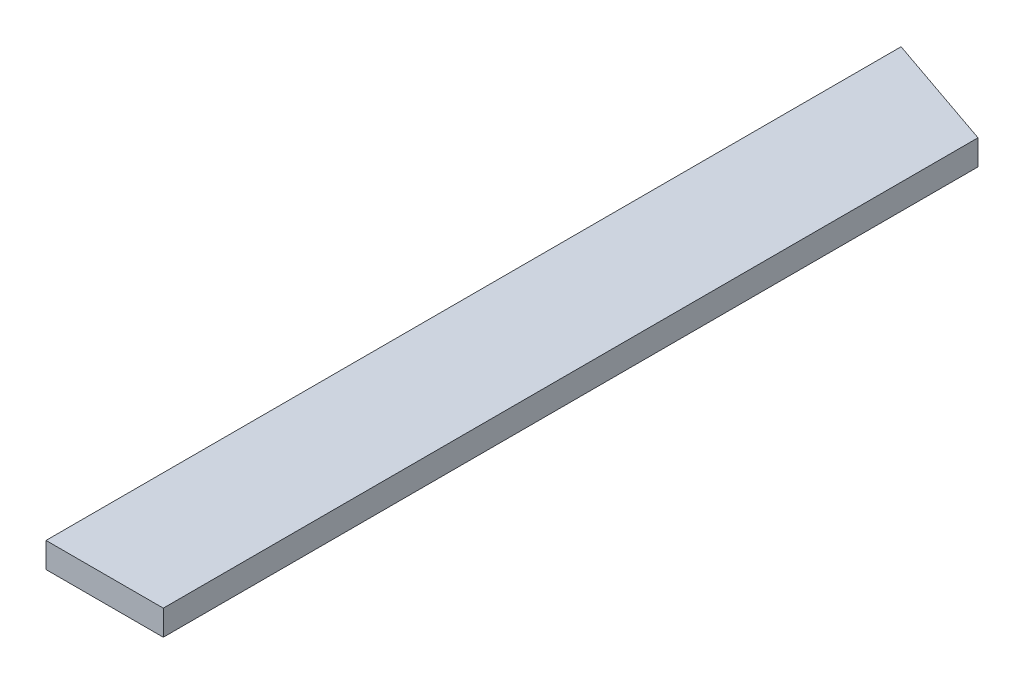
ISO-10303-21;
HEADER;
FILE_DESCRIPTION(('STEP AP214'),'2;1');
FILE_NAME('part.step','',(''),(''),'','','');
FILE_SCHEMA(('AUTOMOTIVE_DESIGN { 1 0 10303 214 1 1 1 1 }'));
ENDSEC;
DATA;
#1=APPLICATION_CONTEXT('core data for automotive mechanical design processes');
#2=APPLICATION_PROTOCOL_DEFINITION('international standard','automotive_design',2000,#1);
#3=PRODUCT_CONTEXT('',#1,'mechanical');
#4=PRODUCT('Part','Part','',(#3));
#5=PRODUCT_RELATED_PRODUCT_CATEGORY('part','',(#4));
#6=PRODUCT_DEFINITION_FORMATION('','',#4);
#7=PRODUCT_DEFINITION_CONTEXT('part definition',#1,'design');
#8=PRODUCT_DEFINITION('design','',#6,#7);
#9=PRODUCT_DEFINITION_SHAPE('','',#8);
#10=(LENGTH_UNIT() NAMED_UNIT(*) SI_UNIT(.MILLI.,.METRE.));
#11=(NAMED_UNIT(*) PLANE_ANGLE_UNIT() SI_UNIT($,.RADIAN.));
#12=(NAMED_UNIT(*) SI_UNIT($,.STERADIAN.) SOLID_ANGLE_UNIT());
#13=UNCERTAINTY_MEASURE_WITH_UNIT(LENGTH_MEASURE(1.E-05),#10,'distance_accuracy_value','');
#14=(GEOMETRIC_REPRESENTATION_CONTEXT(3) GLOBAL_UNCERTAINTY_ASSIGNED_CONTEXT((#13)) GLOBAL_UNIT_ASSIGNED_CONTEXT((#10,
#11,#12)) REPRESENTATION_CONTEXT('',''));
#15=CARTESIAN_POINT('',(0.,0.,0.));
#16=DIRECTION('',(0.,0.,1.));
#17=DIRECTION('',(1.,0.,0.));
#18=AXIS2_PLACEMENT_3D('',#15,#16,#17);
#19=CARTESIAN_POINT('',(295.275,127.,-2361.30211));
#20=DIRECTION('',(-1.,0.,0.));
#21=DIRECTION('',(0.,0.,1.));
#22=AXIS2_PLACEMENT_3D('',#19,#20,#21);
#23=PLANE('',#22);
#24=DIRECTION('',(0.,0.,-1.));
#25=VECTOR('',#24,1.);
#26=CARTESIAN_POINT('',(295.275,0.,-2361.30211));
#27=LINE('',#26,#25);
#28=CARTESIAN_POINT('',(295.275,0.,2361.30211));
#29=VERTEX_POINT('',#28);
#30=CARTESIAN_POINT('',(295.275,0.,-1740.5770805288));
#31=VERTEX_POINT('',#30);
#32=EDGE_CURVE('E80',#29,#31,#27,.T.);
#33=ORIENTED_EDGE('',*,*,#32,.T.);
#34=DIRECTION('',(0.,-1.,0.));
#35=VECTOR('',#34,1.);
#36=CARTESIAN_POINT('',(295.275,127.,-1740.5770805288));
#37=LINE('',#36,#35);
#38=CARTESIAN_POINT('',(295.275,127.,-1740.5770805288));
#39=VERTEX_POINT('',#38);
#40=EDGE_CURVE('E46',#39,#31,#37,.T.);
#41=ORIENTED_EDGE('',*,*,#40,.F.);
#42=DIRECTION('',(0.,0.,-1.));
#43=VECTOR('',#42,1.);
#44=CARTESIAN_POINT('',(295.275,127.,-2361.30211));
#45=LINE('',#44,#43);
#46=CARTESIAN_POINT('',(295.275,127.,2361.30211));
#47=VERTEX_POINT('',#46);
#48=EDGE_CURVE('E75',#47,#39,#45,.T.);
#49=ORIENTED_EDGE('',*,*,#48,.F.);
#50=DIRECTION('',(0.,-1.,0.));
#51=VECTOR('',#50,1.);
#52=CARTESIAN_POINT('',(295.275,127.,2361.30211));
#53=LINE('',#52,#51);
#54=EDGE_CURVE('E39',#47,#29,#53,.T.);
#55=ORIENTED_EDGE('',*,*,#54,.T.);
#56=EDGE_LOOP('',(#33,#41,#49,#55));
#57=FACE_BOUND('',#56,.T.);
#58=ADVANCED_FACE('F32',(#57),#23,.F.);
#59=CARTESIAN_POINT('',(-295.275,127.,-2361.30211));
#60=DIRECTION('',(1.,0.,0.));
#61=DIRECTION('',(0.,0.,-1.));
#62=AXIS2_PLACEMENT_3D('',#59,#60,#61);
#63=PLANE('',#62);
#64=DIRECTION('',(0.,0.,1.));
#65=VECTOR('',#64,1.);
#66=CARTESIAN_POINT('',(-295.275,127.,-2361.30211));
#67=LINE('',#66,#65);
#68=CARTESIAN_POINT('',(-295.275,127.,-1943.91975255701));
#69=VERTEX_POINT('',#68);
#70=CARTESIAN_POINT('',(-295.275,127.,2361.30211));
#71=VERTEX_POINT('',#70);
#72=EDGE_CURVE('E89',#69,#71,#67,.T.);
#73=ORIENTED_EDGE('',*,*,#72,.F.);
#74=DIRECTION('',(0.,-1.,0.));
#75=VECTOR('',#74,1.);
#76=CARTESIAN_POINT('',(-295.275,127.,-1943.91975255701));
#77=LINE('',#76,#75);
#78=CARTESIAN_POINT('',(-295.275,0.,-1943.91975255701));
#79=VERTEX_POINT('',#78);
#80=EDGE_CURVE('E85',#69,#79,#77,.T.);
#81=ORIENTED_EDGE('',*,*,#80,.T.);
#82=DIRECTION('',(0.,0.,1.));
#83=VECTOR('',#82,1.);
#84=CARTESIAN_POINT('',(-295.275,0.,-2361.30211));
#85=LINE('',#84,#83);
#86=CARTESIAN_POINT('',(-295.275,0.,2361.30211));
#87=VERTEX_POINT('',#86);
#88=EDGE_CURVE('E76',#79,#87,#85,.T.);
#89=ORIENTED_EDGE('',*,*,#88,.T.);
#90=DIRECTION('',(0.,-1.,0.));
#91=VECTOR('',#90,1.);
#92=CARTESIAN_POINT('',(-295.275,127.,2361.30211));
#93=LINE('',#92,#91);
#94=EDGE_CURVE('E11',#71,#87,#93,.T.);
#95=ORIENTED_EDGE('',*,*,#94,.F.);
#96=EDGE_LOOP('',(#73,#81,#89,#95));
#97=FACE_BOUND('',#96,.T.);
#98=ADVANCED_FACE('F104',(#97),#63,.F.);
#99=CARTESIAN_POINT('',(-295.275,127.,2361.30211));
#100=DIRECTION('',(0.,0.,-1.));
#101=DIRECTION('',(-1.,0.,0.));
#102=AXIS2_PLACEMENT_3D('',#99,#100,#101);
#103=PLANE('',#102);
#104=DIRECTION('',(1.,0.,0.));
#105=VECTOR('',#104,1.);
#106=CARTESIAN_POINT('',(-295.275,0.,2361.30211));
#107=LINE('',#106,#105);
#108=EDGE_CURVE('E67',#87,#29,#107,.T.);
#109=ORIENTED_EDGE('',*,*,#108,.T.);
#110=ORIENTED_EDGE('',*,*,#54,.F.);
#111=DIRECTION('',(1.,0.,0.));
#112=VECTOR('',#111,1.);
#113=CARTESIAN_POINT('',(-295.275,127.,2361.30211));
#114=LINE('',#113,#112);
#115=EDGE_CURVE('E55',#71,#47,#114,.T.);
#116=ORIENTED_EDGE('',*,*,#115,.F.);
#117=ORIENTED_EDGE('',*,*,#94,.T.);
#118=EDGE_LOOP('',(#109,#110,#116,#117));
#119=FACE_BOUND('',#118,.T.);
#120=ADVANCED_FACE('F69',(#119),#103,.F.);
#121=CARTESIAN_POINT('',(295.275,127.,2361.30211));
#122=DIRECTION('',(0.,1.,0.));
#123=DIRECTION('',(0.,0.,1.));
#124=AXIS2_PLACEMENT_3D('',#121,#122,#123);
#125=PLANE('',#124);
#126=DIRECTION('',(-0.945518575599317,0.,-0.325568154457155));
#127=VECTOR('',#126,1.);
#128=CARTESIAN_POINT('',(295.275,127.,-1740.5770805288));
#129=LINE('',#128,#127);
#130=EDGE_CURVE('E93',#39,#69,#129,.T.);
#131=ORIENTED_EDGE('',*,*,#130,.T.);
#132=ORIENTED_EDGE('',*,*,#72,.T.);
#133=ORIENTED_EDGE('',*,*,#115,.T.);
#134=ORIENTED_EDGE('',*,*,#48,.T.);
#135=EDGE_LOOP('',(#131,#132,#133,#134));
#136=FACE_BOUND('',#135,.T.);
#137=ADVANCED_FACE('F99',(#136),#125,.T.);
#138=CARTESIAN_POINT('',(295.275,0.,2361.30211));
#139=DIRECTION('',(0.,1.,0.));
#140=DIRECTION('',(0.,0.,1.));
#141=AXIS2_PLACEMENT_3D('',#138,#139,#140);
#142=PLANE('',#141);
#143=ORIENTED_EDGE('',*,*,#88,.F.);
#144=DIRECTION('',(-0.945518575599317,0.,-0.325568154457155));
#145=VECTOR('',#144,1.);
#146=CARTESIAN_POINT('',(295.275,0.,-1740.5770805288));
#147=LINE('',#146,#145);
#148=EDGE_CURVE('E82',#31,#79,#147,.T.);
#149=ORIENTED_EDGE('',*,*,#148,.F.);
#150=ORIENTED_EDGE('',*,*,#32,.F.);
#151=ORIENTED_EDGE('',*,*,#108,.F.);
#152=EDGE_LOOP('',(#143,#149,#150,#151));
#153=FACE_BOUND('',#152,.T.);
#154=ADVANCED_FACE('F81',(#153),#142,.F.);
#155=CARTESIAN_POINT('',(295.275,127.,-1740.5770805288));
#156=DIRECTION('',(-0.325568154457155,0.,0.945518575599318));
#157=DIRECTION('',(0.945518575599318,0.,0.325568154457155));
#158=AXIS2_PLACEMENT_3D('',#155,#156,#157);
#159=PLANE('',#158);
#160=ORIENTED_EDGE('',*,*,#148,.T.);
#161=ORIENTED_EDGE('',*,*,#80,.F.);
#162=ORIENTED_EDGE('',*,*,#130,.F.);
#163=ORIENTED_EDGE('',*,*,#40,.T.);
#164=EDGE_LOOP('',(#160,#161,#162,#163));
#165=FACE_BOUND('',#164,.T.);
#166=ADVANCED_FACE('F106',(#165),#159,.F.);
#167=CLOSED_SHELL('',(#58,#98,#120,#137,#154,#166));
#168=MANIFOLD_SOLID_BREP('B2',#167);
#169=ADVANCED_BREP_SHAPE_REPRESENTATION('',(#18,#168),#14);
#170=SHAPE_DEFINITION_REPRESENTATION(#9,#169);
ENDSEC;
END-ISO-10303-21;
